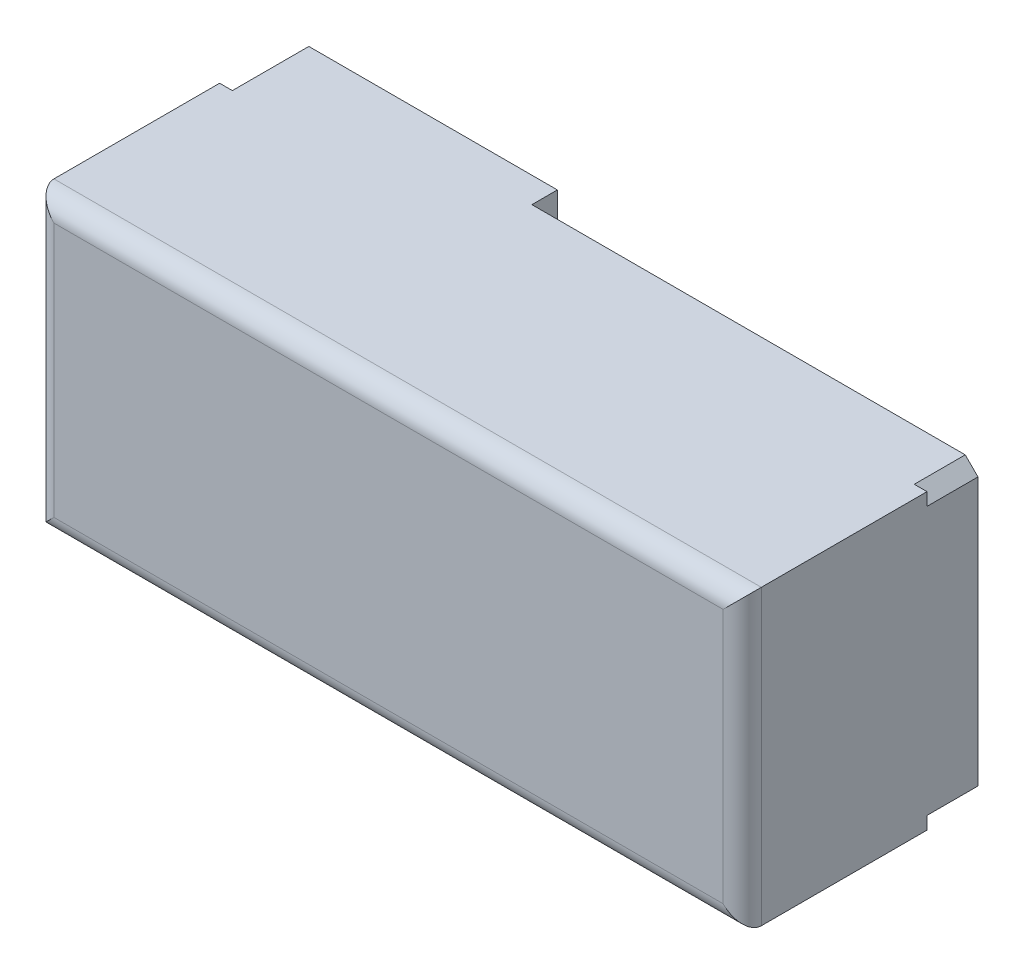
from build123d import *

# Parameters (mm, degrees)
SKETCH_1_W          = 111
SKETCH_1_H          = 46
EXTRUDE_1_DEPTH     = 8
SKETCH_2_R          = 7.5
CUT_EXTRUDE_1_DEPTH = 61.607342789
CHAMFER_2_SIZE      = 2
EXTRUDE_3_DEPTH     = 4
SKETCH_13_R         = 15.1
CUT_EXTRUDE_4_DEPTH = 61.607342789
SKETCH_14_W         = 111
SKETCH_14_H         = 46
EXTRUDE_4_DEPTH     = 29
FILLET_1_R          = 3


with BuildPart() as part:
    # Sketch 1 → Extrude 1 (new body)
    with BuildSketch(Plane.XY):
        Rectangle(SKETCH_1_W, SKETCH_1_H)
    extrude(amount=EXTRUDE_1_DEPTH)

    # Sketch 2 → Cut-Extrude 1 (cut, through all)
    with BuildSketch(Plane.XY.offset(8)):
        with Locations((-34.5, 0)):
            Circle(SKETCH_2_R)
        with BuildLine():
            Line((19, 5), (29, 5))
            ThreePointArc((29, 5), (34, 0), (29, -5))
            Line((29, -5), (19, -5))
            ThreePointArc((19, -5), (14, 0), (19, 5))
        make_face()
    extrude(amount=-CUT_EXTRUDE_1_DEPTH, mode=Mode.SUBTRACT)

    # Chamfer 2
    chamfer_2_edges = [part.edges().sort_by_distance(p)[0] for p in [
        (55.5, -23, 4),
        (-55.5, -23, 4),
        (-55.5, 23, 4),
        (55.5, 23, 4),
    ]]
    chamfer(chamfer_2_edges, length=CHAMFER_2_SIZE)

    # Sketch 12 → Extrude 3 (add)
    with BuildSketch(Plane(origin=(0, 0, 0), x_dir=(-1, 0, 0), z_dir=(0, 0, -1))):
        Polygon((14.5, 23), (53.5, 23), (55.5, 21), (55.5, -21), (53.5, -23), (14.5, -23), align=None)
    extrude(amount=EXTRUDE_3_DEPTH)

    # Sketch 13 → Cut-Extrude 4 (cut, through all)
    with BuildSketch(Plane.XY):
        with Locations((-34.5, 0)):
            Circle(SKETCH_13_R)
    extrude(amount=-CUT_EXTRUDE_4_DEPTH, mode=Mode.SUBTRACT)

    # Sketch 14 → Extrude 4 (add)
    with BuildSketch(Plane.XY.offset(8)):
        Rectangle(SKETCH_14_W, SKETCH_14_H)
    extrude(amount=EXTRUDE_4_DEPTH)

    # Fillet 1
    fillet_1_edges = [part.edges().sort_by_distance(p)[0] for p in [
        (-55.5, 0, 37),
        (0, -23, 37),
        (55.5, 0, 37),
        (0, 23, 37),
    ]]
    fillet(fillet_1_edges, radius=FILLET_1_R)


solid = part.part
